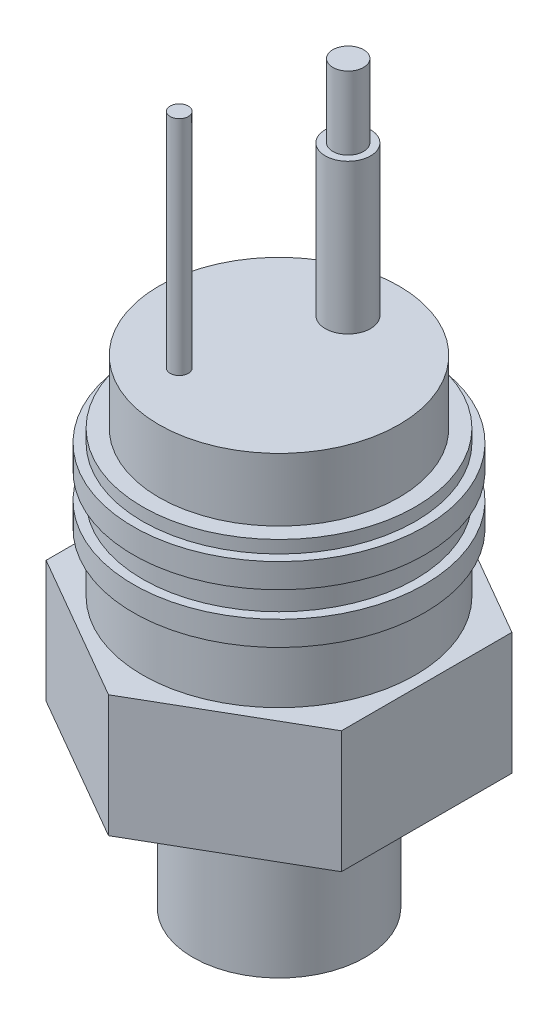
from build123d import *

# Parameters (mm, degrees)
EXTRUDE1_DEPTH = 7.874
SKETCH3_R      = 7.747
EXTRUDE2_DEPTH = 4.064
SKETCH4_R      = 1.4605
EXTRUDE3_DEPTH = 9.652
SKETCH5_R      = 0.9906
EXTRUDE4_DEPTH = 4.699
SKETCH8_R      = 5.55625
EXTRUDE7_DEPTH = 9.525
SKETCH9_R      = 0.89
SKETCH11_R     = 0.585027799
EXTRUDE8_DEPTH = 14.351


with BuildPart() as part:
    # Sketch1 → Extrude1 (new body)
    with BuildSketch(Plane(origin=(0, 0, 0), x_dir=(1, 0, 0), z_dir=(0, 1, 0))):
        Polygon((0, 10.998522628), (-9.525, 5.499261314), (-9.525, -5.499261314), (0, -10.998522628), (9.525, -5.499261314), (9.525, 5.499261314), align=None)
    extrude(amount=EXTRUDE1_DEPTH)

    # Sketch2 → Revolve1 (revolve)
    with BuildSketch(Plane.XY, mode=Mode.PRIVATE) as revolve1_sk:
        Polygon((8.8011, 7.874), (8.8011, 11.6586), (9.398, 11.6586), (9.398, 13.2334), (8.8011, 13.2334), (8.8011, 14.8844), (9.398, 14.8844), (9.398, 16.4592), (8.8011, 16.4592), (8.8011, 17.272), (0, 17.272), (0, 7.874), align=None)
    revolve(revolve1_sk.sketch.rotate(Axis((0, 0, 0), (0, -1, 0)), 180), axis=Axis((0, 0, 0), (0, -1, 0)))

    # Sketch3 → Extrude2 (add)
    with BuildSketch(Plane(origin=(0, 17.272, 0), x_dir=(-1, 0, 0), z_dir=(0, 1, 0))):
        with Locations(Location((0, 0, 0), (0, 0, 180))):
            Circle(SKETCH3_R)
    extrude(amount=EXTRUDE2_DEPTH)

    # Sketch4 → Extrude3 (add)
    with BuildSketch(Plane(origin=(0, 21.336, 0), x_dir=(-1, 0, 0), z_dir=(0, 1, 0))):
        with Locations((0, -4.445)):
            Circle(SKETCH4_R)
    extrude(amount=EXTRUDE3_DEPTH)

    # Sketch5 → Extrude4 (add)
    with BuildSketch(Plane(origin=(0, 30.988, 0), x_dir=(-1, 0, 0), z_dir=(0, 1, 0))):
        with Locations((0, -4.463933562)):
            Circle(SKETCH5_R)
    extrude(amount=EXTRUDE4_DEPTH)

    # Sketch8 → Extrude7 (add)
    with BuildSketch(Plane.XZ):
        with Locations(Location((0, 0, 0), (0, 0, 90))):
            Circle(SKETCH8_R)
    extrude(amount=EXTRUDE7_DEPTH)

    # Sketch9 → o-ring 12.42x1.78 (revolve)
    with BuildSketch(Plane.XY, mode=Mode.PRIVATE) as o_ring_12_42x1_78_sk:
        with Locations((7.1, 0.284318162)):
            Circle(SKETCH9_R)
    revolve(o_ring_12_42x1_78_sk.sketch.rotate(Axis((0, 0, 0), (0, -1, 0)), 90), axis=Axis((0, 0, 0), (0, -1, 0)))

    # Sketch11 → Extrude8 (add)
    with BuildSketch(Plane(origin=(0, 21.336, 0), x_dir=(-1, 0, 0), z_dir=(0, 1, 0))):
        with Locations((2.50261892, 3.932686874)):
            Circle(SKETCH11_R)
    extrude(amount=EXTRUDE8_DEPTH)


solid = part.part
